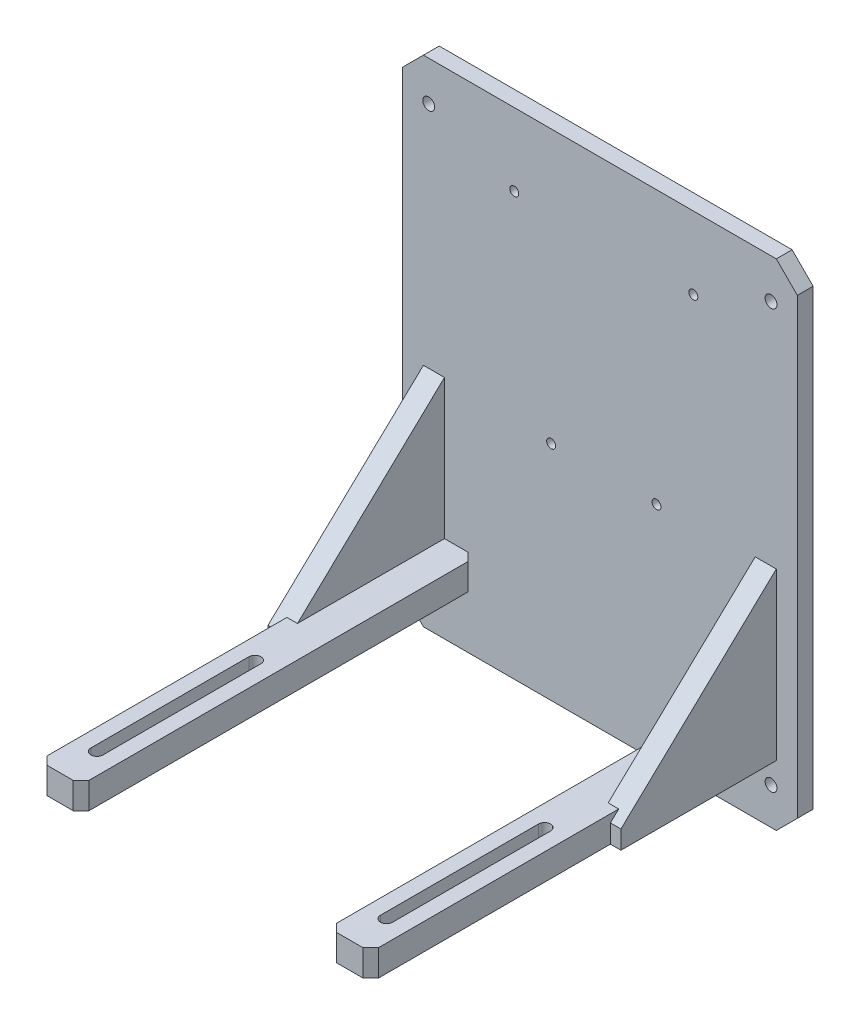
from build123d import *

# Parameters (mm, degrees)
SKETCH_1_R                          = 1.7
SKETCH_1_R_2                        = 2.25
BASE_150X188X6_DEPTH                = 6
SIDE_RAILS_OPEN94_M4_TRAVEL60_START = -105
SIDE_RAILS_OPEN94_M4_TRAVEL60_DEPTH = 10
LEFT_GUSSET_START                   = -67
LEFT_GUSSET_DEPTH                   = 8
RIGHT_GUSSET_START                  = 59
RIGHT_GUSSET_DEPTH                  = 8


with BuildPart() as part:
    # Sketch 1 → Base_150x188x6 (new body)
    with BuildSketch(Plane.XY):
        Polygon((-67, -128), (67, -128), (75, -120), (75, 52), (67, 60), (-67, 60), (-75, 52), (-75, -120), align=None)
        with Locations((-32.5, 32.5)):
            Circle(SKETCH_1_R, mode=Mode.SUBTRACT)
        with Locations((35.5, 32.5)):
            Circle(SKETCH_1_R, mode=Mode.SUBTRACT)
        with Locations((-18.5, -43.5)):
            Circle(SKETCH_1_R, mode=Mode.SUBTRACT)
        with Locations((21.5, -43.5)):
            Circle(SKETCH_1_R, mode=Mode.SUBTRACT)
        with Locations((-65, -114)):
            Circle(SKETCH_1_R_2, mode=Mode.SUBTRACT)
        with Locations((65, -114)):
            Circle(SKETCH_1_R_2, mode=Mode.SUBTRACT)
        with Locations((-65, 45)):
            Circle(SKETCH_1_R_2, mode=Mode.SUBTRACT)
        with Locations((65, 45)):
            Circle(SKETCH_1_R_2, mode=Mode.SUBTRACT)
    extrude(amount=BASE_150X188X6_DEPTH)

    # Sketch 2 → Side_rails_open94_M4_travel60 (add)
    # profile 1 of 2: a face of its own
    with BuildSketch(Plane(origin=(0, 0, 0), x_dir=(1, 0, 0), z_dir=(0, 1, 0)).offset(SIDE_RAILS_OPEN94_M4_TRAVEL60_START)):
        Polygon((-60, -6), (-50, -6), (-47, -9), (-47, -153), (-50, -156), (-60, -156), (-63, -153), (-63, -9), align=None)
        with BuildLine():
            Line((-57.3, -82), (-57.3, -142))
            ThreePointArc((-57.3, -142), (-55, -144.3), (-52.7, -142))
            Line((-52.7, -142), (-52.7, -82))
            ThreePointArc((-52.7, -82), (-55, -79.7), (-57.3, -82))
        make_face(mode=Mode.SUBTRACT)
    # profile 2 of 2: a face of its own
    with BuildSketch(Plane(origin=(0, 0, 0), x_dir=(1, 0, 0), z_dir=(0, 1, 0)).offset(SIDE_RAILS_OPEN94_M4_TRAVEL60_START)):
        Polygon((50, -6), (60, -6), (63, -9), (63, -153), (60, -156), (50, -156), (47, -153), (47, -9), align=None)
        with BuildLine():
            Line((52.7, -82), (52.7, -142))
            ThreePointArc((52.7, -142), (55, -144.3), (57.3, -142))
            Line((57.3, -142), (57.3, -82))
            ThreePointArc((57.3, -82), (55, -79.7), (52.7, -82))
        make_face(mode=Mode.SUBTRACT)
    extrude(amount=SIDE_RAILS_OPEN94_M4_TRAVEL60_DEPTH)

    # Sketch 3 → Left_gusset (add)
    with BuildSketch(Plane(origin=(0, 0, 0), x_dir=(0, 0, -1), z_dir=(1, 0, 0)).offset(LEFT_GUSSET_START)):
        Polygon((-6, -105), (-6, -42), (-65, -98), (-65, -105), align=None)
    extrude(amount=LEFT_GUSSET_DEPTH)

    # Sketch 4 → Right_gusset (add)
    with BuildSketch(Plane(origin=(0, 0, 0), x_dir=(0, 0, -1), z_dir=(1, 0, 0)).offset(RIGHT_GUSSET_START)):
        Polygon((-6, -105), (-6, -42), (-65, -98), (-65, -105), align=None)
    extrude(amount=RIGHT_GUSSET_DEPTH)


solid = part.part
